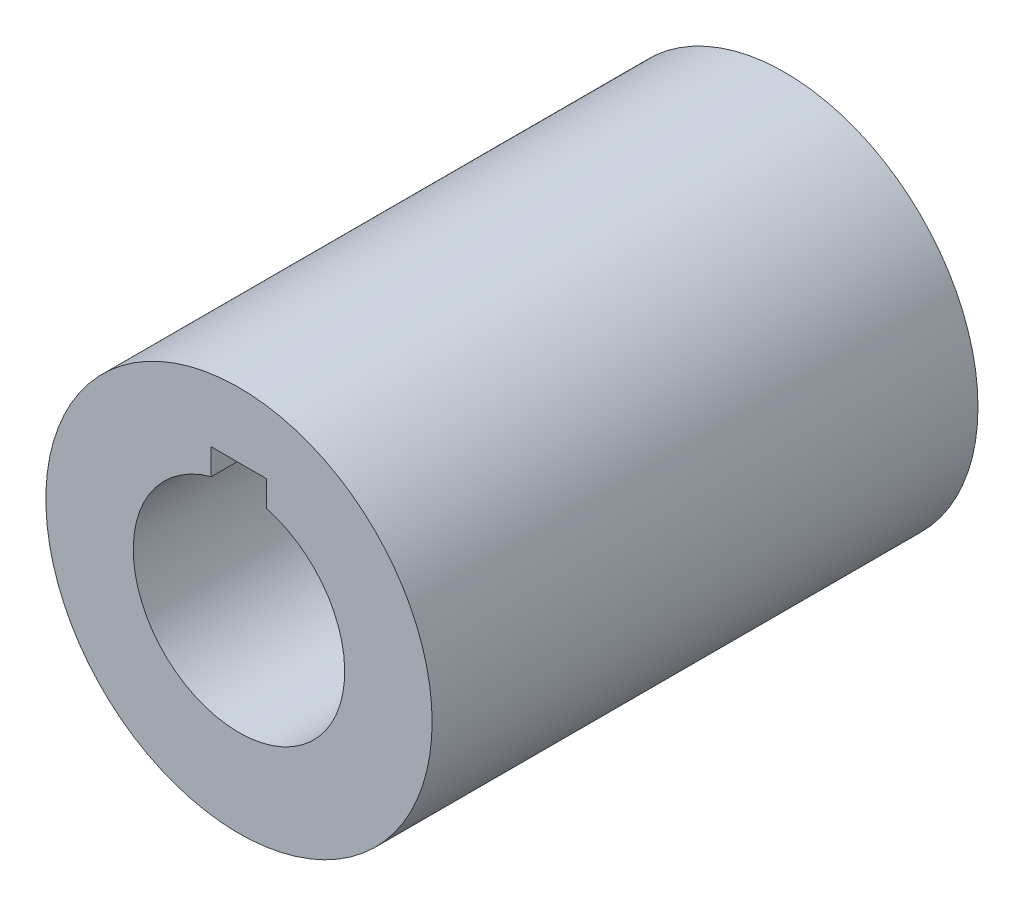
ISO-10303-21;
HEADER;
FILE_DESCRIPTION(('STEP AP214'),'2;1');
FILE_NAME('part.step','',(''),(''),'','','');
FILE_SCHEMA(('AUTOMOTIVE_DESIGN { 1 0 10303 214 1 1 1 1 }'));
ENDSEC;
DATA;
#1=APPLICATION_CONTEXT('core data for automotive mechanical design processes');
#2=APPLICATION_PROTOCOL_DEFINITION('international standard','automotive_design',2000,#1);
#3=PRODUCT_CONTEXT('',#1,'mechanical');
#4=PRODUCT('Part','Part','',(#3));
#5=PRODUCT_RELATED_PRODUCT_CATEGORY('part','',(#4));
#6=PRODUCT_DEFINITION_FORMATION('','',#4);
#7=PRODUCT_DEFINITION_CONTEXT('part definition',#1,'design');
#8=PRODUCT_DEFINITION('design','',#6,#7);
#9=PRODUCT_DEFINITION_SHAPE('','',#8);
#10=(LENGTH_UNIT() NAMED_UNIT(*) SI_UNIT(.MILLI.,.METRE.));
#11=(NAMED_UNIT(*) PLANE_ANGLE_UNIT() SI_UNIT($,.RADIAN.));
#12=(NAMED_UNIT(*) SI_UNIT($,.STERADIAN.) SOLID_ANGLE_UNIT());
#13=UNCERTAINTY_MEASURE_WITH_UNIT(LENGTH_MEASURE(1.E-05),#10,'distance_accuracy_value','');
#14=(GEOMETRIC_REPRESENTATION_CONTEXT(3) GLOBAL_UNCERTAINTY_ASSIGNED_CONTEXT((#13)) GLOBAL_UNIT_ASSIGNED_CONTEXT((#10,
#11,#12)) REPRESENTATION_CONTEXT('',''));
#15=CARTESIAN_POINT('',(0.,0.,0.));
#16=DIRECTION('',(0.,0.,1.));
#17=DIRECTION('',(1.,0.,0.));
#18=AXIS2_PLACEMENT_3D('',#15,#16,#17);
#19=CARTESIAN_POINT('',(0.,0.,49.18));
#20=DIRECTION('',(0.,0.,1.));
#21=DIRECTION('',(1.,0.,0.));
#22=AXIS2_PLACEMENT_3D('',#19,#20,#21);
#23=PLANE('',#22);
#24=CARTESIAN_POINT('',(0.,0.,49.18));
#25=DIRECTION('',(0.,0.,1.));
#26=DIRECTION('',(1.,0.,0.));
#27=AXIS2_PLACEMENT_3D('',#24,#25,#26);
#28=CIRCLE('',#27,17.4);
#29=CARTESIAN_POINT('',(17.4,0.,49.18));
#30=VERTEX_POINT('',#29);
#31=EDGE_CURVE('E11',#30,#30,#28,.T.);
#32=ORIENTED_EDGE('',*,*,#31,.T.);
#33=EDGE_LOOP('',(#32));
#34=FACE_BOUND('',#33,.T.);
#35=CARTESIAN_POINT('',(0.,0.,49.18));
#36=DIRECTION('',(0.,0.,1.));
#37=DIRECTION('',(1.,0.,0.));
#38=AXIS2_PLACEMENT_3D('',#35,#36,#37);
#39=CIRCLE('',#38,9.525);
#40=CARTESIAN_POINT('',(-2.5,9.19106223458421,49.18));
#41=VERTEX_POINT('',#40);
#42=CARTESIAN_POINT('',(2.5,9.19106223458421,49.18));
#43=VERTEX_POINT('',#42);
#44=EDGE_CURVE('E98',#41,#43,#39,.T.);
#45=ORIENTED_EDGE('',*,*,#44,.F.);
#46=DIRECTION('',(0.,-1.,0.));
#47=VECTOR('',#46,1.);
#48=CARTESIAN_POINT('',(-2.5,11.525,49.18));
#49=LINE('',#48,#47);
#50=CARTESIAN_POINT('',(-2.5,11.525,49.18));
#51=VERTEX_POINT('',#50);
#52=EDGE_CURVE('E88',#51,#41,#49,.T.);
#53=ORIENTED_EDGE('',*,*,#52,.F.);
#54=DIRECTION('',(-1.,0.,0.));
#55=VECTOR('',#54,1.);
#56=CARTESIAN_POINT('',(-2.5,11.525,49.18));
#57=LINE('',#56,#55);
#58=CARTESIAN_POINT('',(2.5,11.525,49.18));
#59=VERTEX_POINT('',#58);
#60=EDGE_CURVE('E102',#59,#51,#57,.T.);
#61=ORIENTED_EDGE('',*,*,#60,.F.);
#62=DIRECTION('',(0.,1.,0.));
#63=VECTOR('',#62,1.);
#64=CARTESIAN_POINT('',(2.5,11.525,49.18));
#65=LINE('',#64,#63);
#66=EDGE_CURVE('E100',#43,#59,#65,.T.);
#67=ORIENTED_EDGE('',*,*,#66,.F.);
#68=EDGE_LOOP('',(#45,#53,#61,#67));
#69=FACE_BOUND('',#68,.T.);
#70=ADVANCED_FACE('F32',(#34,#69),#23,.T.);
#71=CARTESIAN_POINT('',(0.,0.,0.));
#72=DIRECTION('',(0.,0.,1.));
#73=DIRECTION('',(1.,0.,0.));
#74=AXIS2_PLACEMENT_3D('',#71,#72,#73);
#75=PLANE('',#74);
#76=CARTESIAN_POINT('',(0.,0.,0.));
#77=DIRECTION('',(0.,0.,1.));
#78=DIRECTION('',(1.,0.,0.));
#79=AXIS2_PLACEMENT_3D('',#76,#77,#78);
#80=CIRCLE('',#79,17.4);
#81=CARTESIAN_POINT('',(17.4,0.,0.));
#82=VERTEX_POINT('',#81);
#83=EDGE_CURVE('E40',#82,#82,#80,.T.);
#84=ORIENTED_EDGE('',*,*,#83,.F.);
#85=EDGE_LOOP('',(#84));
#86=FACE_BOUND('',#85,.T.);
#87=DIRECTION('',(0.,-1.,0.));
#88=VECTOR('',#87,1.);
#89=CARTESIAN_POINT('',(-2.5,11.525,0.));
#90=LINE('',#89,#88);
#91=CARTESIAN_POINT('',(-2.5,11.525,0.));
#92=VERTEX_POINT('',#91);
#93=CARTESIAN_POINT('',(-2.5,9.19106223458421,0.));
#94=VERTEX_POINT('',#93);
#95=EDGE_CURVE('E55',#92,#94,#90,.T.);
#96=ORIENTED_EDGE('',*,*,#95,.T.);
#97=CARTESIAN_POINT('',(0.,0.,0.));
#98=DIRECTION('',(0.,0.,1.));
#99=DIRECTION('',(1.,0.,0.));
#100=AXIS2_PLACEMENT_3D('',#97,#98,#99);
#101=CIRCLE('',#100,9.525);
#102=CARTESIAN_POINT('',(2.5,9.19106223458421,0.));
#103=VERTEX_POINT('',#102);
#104=EDGE_CURVE('E75',#94,#103,#101,.T.);
#105=ORIENTED_EDGE('',*,*,#104,.T.);
#106=DIRECTION('',(0.,1.,0.));
#107=VECTOR('',#106,1.);
#108=CARTESIAN_POINT('',(2.5,11.525,0.));
#109=LINE('',#108,#107);
#110=CARTESIAN_POINT('',(2.5,11.525,0.));
#111=VERTEX_POINT('',#110);
#112=EDGE_CURVE('E84',#103,#111,#109,.T.);
#113=ORIENTED_EDGE('',*,*,#112,.T.);
#114=DIRECTION('',(-1.,0.,0.));
#115=VECTOR('',#114,1.);
#116=CARTESIAN_POINT('',(-2.5,11.525,0.));
#117=LINE('',#116,#115);
#118=EDGE_CURVE('E92',#111,#92,#117,.T.);
#119=ORIENTED_EDGE('',*,*,#118,.T.);
#120=EDGE_LOOP('',(#96,#105,#113,#119));
#121=FACE_BOUND('',#120,.T.);
#122=ADVANCED_FACE('F91',(#86,#121),#75,.F.);
#123=CARTESIAN_POINT('',(0.,0.,49.18));
#124=DIRECTION('',(0.,0.,-1.));
#125=DIRECTION('',(-1.,0.,0.));
#126=AXIS2_PLACEMENT_3D('',#123,#124,#125);
#127=CYLINDRICAL_SURFACE('',#126,17.4);
#128=ORIENTED_EDGE('',*,*,#31,.F.);
#129=EDGE_LOOP('',(#128));
#130=FACE_BOUND('',#129,.T.);
#131=ORIENTED_EDGE('',*,*,#83,.T.);
#132=EDGE_LOOP('',(#131));
#133=FACE_BOUND('',#132,.T.);
#134=ADVANCED_FACE('F34',(#130,#133),#127,.T.);
#135=CARTESIAN_POINT('',(-2.5,11.525,49.18));
#136=DIRECTION('',(1.,0.,0.));
#137=DIRECTION('',(0.,0.,-1.));
#138=AXIS2_PLACEMENT_3D('',#135,#136,#137);
#139=PLANE('',#138);
#140=ORIENTED_EDGE('',*,*,#95,.F.);
#141=DIRECTION('',(0.,0.,-1.));
#142=VECTOR('',#141,1.);
#143=CARTESIAN_POINT('',(-2.5,11.525,49.18));
#144=LINE('',#143,#142);
#145=EDGE_CURVE('E104',#51,#92,#144,.T.);
#146=ORIENTED_EDGE('',*,*,#145,.F.);
#147=ORIENTED_EDGE('',*,*,#52,.T.);
#148=DIRECTION('',(0.,0.,-1.));
#149=VECTOR('',#148,1.);
#150=CARTESIAN_POINT('',(-2.5,9.19106223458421,49.18));
#151=LINE('',#150,#149);
#152=EDGE_CURVE('E77',#41,#94,#151,.T.);
#153=ORIENTED_EDGE('',*,*,#152,.T.);
#154=EDGE_LOOP('',(#140,#146,#147,#153));
#155=FACE_BOUND('',#154,.T.);
#156=ADVANCED_FACE('F86',(#155),#139,.T.);
#157=CARTESIAN_POINT('',(0.,0.,49.18));
#158=DIRECTION('',(0.,0.,-1.));
#159=DIRECTION('',(-1.,0.,0.));
#160=AXIS2_PLACEMENT_3D('',#157,#158,#159);
#161=CYLINDRICAL_SURFACE('',#160,9.525);
#162=ORIENTED_EDGE('',*,*,#104,.F.);
#163=ORIENTED_EDGE('',*,*,#152,.F.);
#164=ORIENTED_EDGE('',*,*,#44,.T.);
#165=DIRECTION('',(0.,0.,-1.));
#166=VECTOR('',#165,1.);
#167=CARTESIAN_POINT('',(2.5,9.19106223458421,49.18));
#168=LINE('',#167,#166);
#169=EDGE_CURVE('E80',#43,#103,#168,.T.);
#170=ORIENTED_EDGE('',*,*,#169,.T.);
#171=EDGE_LOOP('',(#162,#163,#164,#170));
#172=FACE_BOUND('',#171,.T.);
#173=ADVANCED_FACE('F76',(#172),#161,.F.);
#174=CARTESIAN_POINT('',(2.5,11.525,49.18));
#175=DIRECTION('',(-1.,0.,0.));
#176=DIRECTION('',(0.,0.,1.));
#177=AXIS2_PLACEMENT_3D('',#174,#175,#176);
#178=PLANE('',#177);
#179=ORIENTED_EDGE('',*,*,#112,.F.);
#180=ORIENTED_EDGE('',*,*,#169,.F.);
#181=ORIENTED_EDGE('',*,*,#66,.T.);
#182=DIRECTION('',(0.,0.,-1.));
#183=VECTOR('',#182,1.);
#184=CARTESIAN_POINT('',(2.5,11.525,49.18));
#185=LINE('',#184,#183);
#186=EDGE_CURVE('E47',#59,#111,#185,.T.);
#187=ORIENTED_EDGE('',*,*,#186,.T.);
#188=EDGE_LOOP('',(#179,#180,#181,#187));
#189=FACE_BOUND('',#188,.T.);
#190=ADVANCED_FACE('F124',(#189),#178,.T.);
#191=CARTESIAN_POINT('',(-2.5,11.525,49.18));
#192=DIRECTION('',(0.,-1.,0.));
#193=DIRECTION('',(0.,0.,-1.));
#194=AXIS2_PLACEMENT_3D('',#191,#192,#193);
#195=PLANE('',#194);
#196=ORIENTED_EDGE('',*,*,#118,.F.);
#197=ORIENTED_EDGE('',*,*,#186,.F.);
#198=ORIENTED_EDGE('',*,*,#60,.T.);
#199=ORIENTED_EDGE('',*,*,#145,.T.);
#200=EDGE_LOOP('',(#196,#197,#198,#199));
#201=FACE_BOUND('',#200,.T.);
#202=ADVANCED_FACE('F127',(#201),#195,.T.);
#203=CLOSED_SHELL('',(#70,#122,#134,#156,#173,#190,#202));
#204=MANIFOLD_SOLID_BREP('B2',#203);
#205=ADVANCED_BREP_SHAPE_REPRESENTATION('',(#18,#204),#14);
#206=SHAPE_DEFINITION_REPRESENTATION(#9,#205);
ENDSEC;
END-ISO-10303-21;
